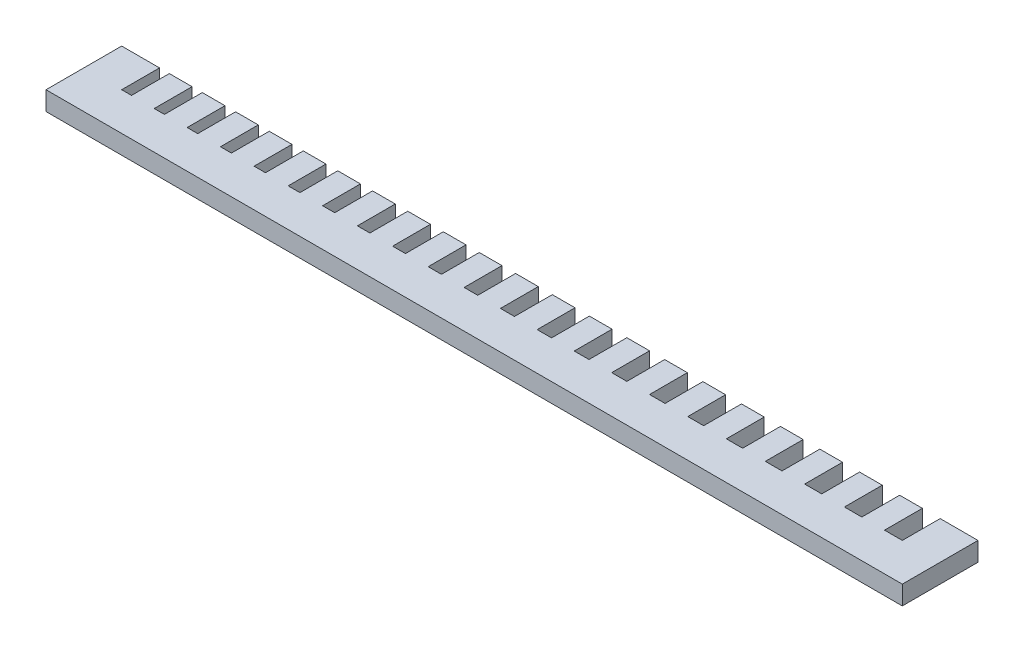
from build123d import *

# Parameters (mm, degrees)
CROQUIS2_W              = 226.3
CROQUIS2_H              = 40
SALIENTE_EXTRUIR2_DEPTH = 5
CORTAR_EXTRUIR1_DEPTH   = 5


with BuildPart() as part:
    # Croquis2 → Saliente-Extruir2 (new body)
    with BuildSketch(Plane(origin=(0, 0, 0), x_dir=(1, 0, 0), z_dir=(0, 1, 0))):
        with Locations((113.15, 20)):
            Rectangle(CROQUIS2_W, CROQUIS2_H)
    extrude(amount=SALIENTE_EXTRUIR2_DEPTH)

    # Croquis1 → Cortar-Extruir1 (cut)
    with BuildSketch(Plane(origin=(0, 0, 0), x_dir=(1, 0, 0), z_dir=(0, 1, 0))):
        Polygon((18.6, 20), (18.6, 10), (21.3, 10), (21.3, 20), (27.3, 20), (27.3, 10), (30.1, 10), (30.1, 20), (36.1, 20), (36.1, 10), (39, 10), (39, 20), (45, 20), (45, 10), (48, 10), (48, 20), (54, 20), (54, 10), (57.1, 10), (57.1, 20), (63.1, 20), (63.1, 10), (66.3, 10), (66.3, 20), (72.3, 20), (72.3, 10), (75.6, 10), (75.6, 20), (81.6, 20), (81.6, 10), (85, 10), (85, 20), (91, 20), (91, 10), (94.5, 10), (94.5, 20), (100.5, 20), (100.5, 10), (104.1, 10), (104.1, 20), (110.1, 20), (110.1, 10), (113.8, 10), (113.8, 20), (119.8, 20), (119.8, 10), (123.6, 10), (123.6, 20), (129.6, 20), (129.6, 10), (133.5, 10), (133.5, 20), (139.5, 20), (139.5, 10), (143.5, 10), (143.5, 20), (149.5, 20), (149.5, 10), (153.6, 10), (153.6, 20), (159.6, 20), (159.6, 10), (163.8, 10), (163.8, 20), (169.8, 20), (169.8, 10), (174.1, 10), (174.1, 20), (180.1, 20), (180.1, 10), (184.5, 10), (184.5, 20), (190.5, 20), (190.5, 10), (195, 10), (195, 20), (201, 20), (201, 10), (205.6, 10), (205.6, 20), (211.6, 20), (211.6, 10), (216.3, 10), (216.3, 20.002705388), (246.3, 20.002705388), (246.3, 40), (0, 40), (0, 20), (10, 20), (10, 10), (12.6, 10), (12.6, 20), align=None)
    extrude(amount=CORTAR_EXTRUIR1_DEPTH, mode=Mode.SUBTRACT)


solid = part.part
